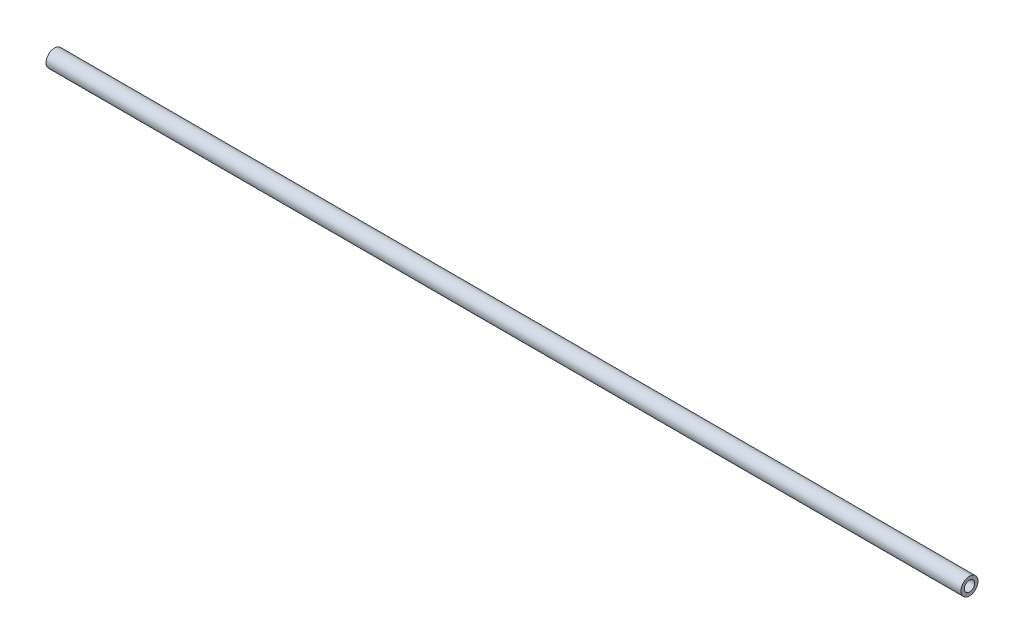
ISO-10303-21;
HEADER;
FILE_DESCRIPTION(('STEP AP214'),'2;1');
FILE_NAME('part.step','',(''),(''),'','','');
FILE_SCHEMA(('AUTOMOTIVE_DESIGN { 1 0 10303 214 1 1 1 1 }'));
ENDSEC;
DATA;
#1=APPLICATION_CONTEXT('core data for automotive mechanical design processes');
#2=APPLICATION_PROTOCOL_DEFINITION('international standard','automotive_design',2000,#1);
#3=PRODUCT_CONTEXT('',#1,'mechanical');
#4=PRODUCT('Part','Part','',(#3));
#5=PRODUCT_RELATED_PRODUCT_CATEGORY('part','',(#4));
#6=PRODUCT_DEFINITION_FORMATION('','',#4);
#7=PRODUCT_DEFINITION_CONTEXT('part definition',#1,'design');
#8=PRODUCT_DEFINITION('design','',#6,#7);
#9=PRODUCT_DEFINITION_SHAPE('','',#8);
#10=(LENGTH_UNIT() NAMED_UNIT(*) SI_UNIT(.MILLI.,.METRE.));
#11=(NAMED_UNIT(*) PLANE_ANGLE_UNIT() SI_UNIT($,.RADIAN.));
#12=(NAMED_UNIT(*) SI_UNIT($,.STERADIAN.) SOLID_ANGLE_UNIT());
#13=UNCERTAINTY_MEASURE_WITH_UNIT(LENGTH_MEASURE(1.E-05),#10,'distance_accuracy_value','');
#14=(GEOMETRIC_REPRESENTATION_CONTEXT(3) GLOBAL_UNCERTAINTY_ASSIGNED_CONTEXT((#13)) GLOBAL_UNIT_ASSIGNED_CONTEXT((#10,
#11,#12)) REPRESENTATION_CONTEXT('',''));
#15=CARTESIAN_POINT('',(0.,0.,0.));
#16=DIRECTION('',(0.,0.,1.));
#17=DIRECTION('',(1.,0.,0.));
#18=AXIS2_PLACEMENT_3D('',#15,#16,#17);
#19=CARTESIAN_POINT('',(0.,0.,0.));
#20=DIRECTION('',(-1.,0.,0.));
#21=DIRECTION('',(0.,0.,1.));
#22=AXIS2_PLACEMENT_3D('',#19,#20,#21);
#23=CYLINDRICAL_SURFACE('',#22,3.96874999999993);
#24=CARTESIAN_POINT('',(-425.45,0.,0.));
#25=DIRECTION('',(1.,0.,0.));
#26=DIRECTION('',(0.,0.,-1.));
#27=AXIS2_PLACEMENT_3D('',#24,#25,#26);
#28=CIRCLE('',#27,3.96874999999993);
#29=CARTESIAN_POINT('',(-425.45,0.,-3.96874999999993));
#30=VERTEX_POINT('',#29);
#31=EDGE_CURVE('E47',#30,#30,#28,.T.);
#32=ORIENTED_EDGE('',*,*,#31,.T.);
#33=EDGE_LOOP('',(#32));
#34=FACE_BOUND('',#33,.T.);
#35=CARTESIAN_POINT('',(0.,0.,0.));
#36=DIRECTION('',(-1.,0.,0.));
#37=DIRECTION('',(0.,0.,1.));
#38=AXIS2_PLACEMENT_3D('',#35,#36,#37);
#39=CIRCLE('',#38,3.96874999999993);
#40=CARTESIAN_POINT('',(0.,0.,3.96874999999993));
#41=VERTEX_POINT('',#40);
#42=EDGE_CURVE('E10',#41,#41,#39,.T.);
#43=ORIENTED_EDGE('',*,*,#42,.T.);
#44=EDGE_LOOP('',(#43));
#45=FACE_BOUND('',#44,.T.);
#46=ADVANCED_FACE('F36',(#34,#45),#23,.T.);
#47=CARTESIAN_POINT('',(0.,3.96874999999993,0.));
#48=DIRECTION('',(-1.,0.,0.));
#49=DIRECTION('',(0.,0.,1.));
#50=AXIS2_PLACEMENT_3D('',#47,#48,#49);
#51=PLANE('',#50);
#52=ORIENTED_EDGE('',*,*,#42,.F.);
#53=EDGE_LOOP('',(#52));
#54=FACE_BOUND('',#53,.T.);
#55=CARTESIAN_POINT('',(0.,0.,0.));
#56=DIRECTION('',(-1.,0.,0.));
#57=DIRECTION('',(0.,0.,1.));
#58=AXIS2_PLACEMENT_3D('',#55,#56,#57);
#59=CIRCLE('',#58,2.38125);
#60=CARTESIAN_POINT('',(0.,0.,2.38125));
#61=VERTEX_POINT('',#60);
#62=EDGE_CURVE('E43',#61,#61,#59,.T.);
#63=ORIENTED_EDGE('',*,*,#62,.T.);
#64=EDGE_LOOP('',(#63));
#65=FACE_BOUND('',#64,.T.);
#66=ADVANCED_FACE('F66',(#54,#65),#51,.F.);
#67=CARTESIAN_POINT('',(0.,0.,0.));
#68=DIRECTION('',(-1.,0.,0.));
#69=DIRECTION('',(0.,0.,1.));
#70=AXIS2_PLACEMENT_3D('',#67,#68,#69);
#71=CYLINDRICAL_SURFACE('',#70,2.38124999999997);
#72=CARTESIAN_POINT('',(-425.45,0.,0.));
#73=DIRECTION('',(1.,0.,0.));
#74=DIRECTION('',(0.,0.,-1.));
#75=AXIS2_PLACEMENT_3D('',#72,#73,#74);
#76=CIRCLE('',#75,2.38124999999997);
#77=CARTESIAN_POINT('',(-425.45,0.,-2.38124999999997));
#78=VERTEX_POINT('',#77);
#79=EDGE_CURVE('E39',#78,#78,#76,.F.);
#80=ORIENTED_EDGE('',*,*,#79,.T.);
#81=EDGE_LOOP('',(#80));
#82=FACE_BOUND('',#81,.T.);
#83=ORIENTED_EDGE('',*,*,#62,.F.);
#84=EDGE_LOOP('',(#83));
#85=FACE_BOUND('',#84,.T.);
#86=ADVANCED_FACE('F56',(#82,#85),#71,.F.);
#87=CARTESIAN_POINT('',(-425.45,75.6637090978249,-5.159375));
#88=DIRECTION('',(1.,0.,0.));
#89=DIRECTION('',(0.,0.,-1.));
#90=AXIS2_PLACEMENT_3D('',#87,#88,#89);
#91=PLANE('',#90);
#92=ORIENTED_EDGE('',*,*,#79,.F.);
#93=EDGE_LOOP('',(#92));
#94=FACE_BOUND('',#93,.T.);
#95=ORIENTED_EDGE('',*,*,#31,.F.);
#96=EDGE_LOOP('',(#95));
#97=FACE_BOUND('',#96,.T.);
#98=ADVANCED_FACE('F59',(#94,#97),#91,.F.);
#99=CLOSED_SHELL('',(#46,#66,#86,#98));
#100=MANIFOLD_SOLID_BREP('B2',#99);
#101=ADVANCED_BREP_SHAPE_REPRESENTATION('',(#18,#100),#14);
#102=SHAPE_DEFINITION_REPRESENTATION(#9,#101);
ENDSEC;
END-ISO-10303-21;
